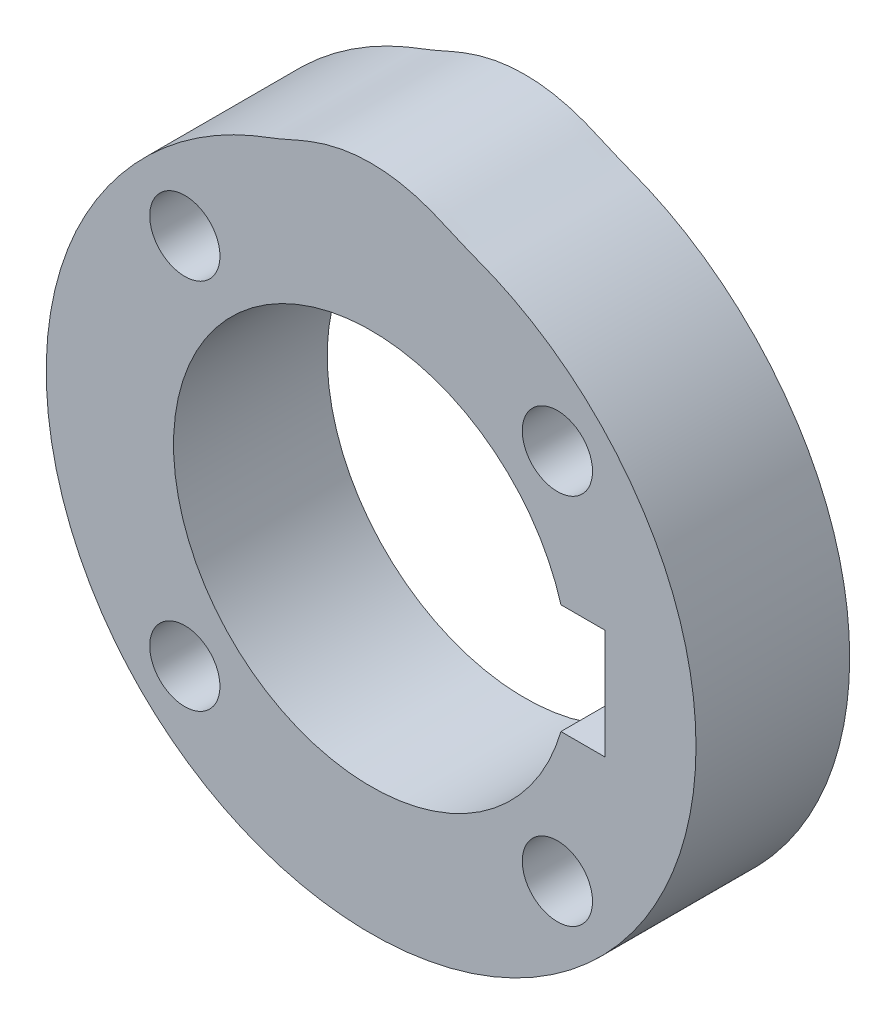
from build123d import *

# Parameters (mm, degrees)
SKIZZE1_R                       = 18
AUFSATZ_LINEAR_AUSTRAGEN1_DEPTH = 14
SCHNITT_LINEAR_AUSTRAGEN4_REACH = 47.228
SKIZZE1_3_R                     = 3.2
SCHNITT_LINEAR_AUSTRAGEN1_DEPTH = 46.22755624


with BuildPart() as part:
    # Skizze1 → Aufsatz-Linear austragen1 (new body)
    with BuildSketch(Plane.XY):
        with BuildLine():
            add(Edge.make_bspline(
                [(-22.821680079, 18.894446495), (-22.780676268, 18.945124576), (-22.630649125, 19.129381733), (-22.36818745, 19.44442358), (-22.03050613, 19.836378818), (-21.686416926, 20.222884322), (-21.33590609, 20.603837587), (-20.978975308, 20.978975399), (-20.615965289, 21.348495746), (-20.246670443, 21.711935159), (-19.871322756, 22.069386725), (-19.489997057, 22.420730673), (-19.102711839, 22.765813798), (-18.70959414, 23.104531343), (-18.310738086, 23.436776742), (-17.906249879, 23.762456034), (-17.496220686, 24.081548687), (-17.080576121, 24.393677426), (-16.659715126, 24.699155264), (-16.233459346, 24.997460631), (-15.802020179, 25.288633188), (-15.365647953, 25.572812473), (-14.924184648, 25.849502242), (-14.477869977, 26.118835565), (-14.026757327, 26.380616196), (-13.571065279, 26.634861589), (-13.110805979, 26.881251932), (-12.646169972, 27.119918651), (-12.177193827, 27.35053652), (-11.704139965, 27.573383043), (-11.226915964, 27.787759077), (-10.745925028, 27.99427584), (-10.261044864, 28.192246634), (-9.772484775, 28.381939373), (-9.282394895, 28.569620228), (-8.79232412, 28.760978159), (-8.302834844, 28.959609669), (-7.813863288, 29.167020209), (-7.324482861, 29.382068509), (-6.83263831, 29.599813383), (-6.339521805, 29.820879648), (-5.832214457, 30.013760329), (-5.331105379, 30.225124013), (-4.815164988, 30.400685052), (-4.29618891, 30.565612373), (-3.771248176, 30.711454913), (-3.241811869, 30.840171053), (-2.708081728, 30.949865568), (-2.170846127, 31.040570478), (-1.630692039, 31.111599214), (-1.088359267, 31.162212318), (-0.647234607, 31.188115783), (-0.387124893, 31.194442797), (-0.308461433, 31.195893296), (-0.239926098, 31.19715704), (-0.102842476, 31.198982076), (0.102842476, 31.198982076), (0.239926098, 31.19715704), (0.308461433, 31.195893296), (0.387124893, 31.194442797), (0.647234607, 31.188115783), (1.088359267, 31.162212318), (1.630692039, 31.111599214), (2.170846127, 31.040570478), (2.708081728, 30.949865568), (3.241811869, 30.840171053), (3.771248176, 30.711454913), (4.29618891, 30.565612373), (4.815164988, 30.400685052), (5.331105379, 30.225124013), (5.832214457, 30.013760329), (6.339521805, 29.820879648), (6.83263831, 29.599813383), (7.324482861, 29.382068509), (7.813863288, 29.167020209), (8.302834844, 28.959609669), (8.79232412, 28.760978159), (9.282394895, 28.569620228), (9.772484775, 28.381939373), (10.261044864, 28.192246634), (10.745925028, 27.99427584), (11.226915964, 27.787759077), (11.704139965, 27.573383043), (12.177193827, 27.35053652), (12.646169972, 27.119918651), (13.110805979, 26.881251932), (13.571065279, 26.634861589), (14.026757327, 26.380616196), (14.477869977, 26.118835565), (14.924184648, 25.849502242), (15.365647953, 25.572812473), (15.802020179, 25.288633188), (16.233459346, 24.997460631), (16.659715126, 24.699155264), (17.080576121, 24.393677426), (17.496220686, 24.081548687), (17.906249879, 23.762456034), (18.310738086, 23.436776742), (18.70959414, 23.104531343), (19.102711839, 22.765813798), (19.489997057, 22.420730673), (19.871322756, 22.069386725), (20.246670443, 21.711935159), (20.615965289, 21.348495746), (20.978975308, 20.978975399), (21.33590609, 20.603837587), (21.686416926, 20.222884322), (22.03050613, 19.836378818), (22.36818745, 19.44442358), (22.630649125, 19.129381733), (22.780676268, 18.945124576), (22.821680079, 18.894446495), (23.246798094, 18.369027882), (24.063383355, 17.2909637), (25.187166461, 15.590768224), (25.858974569, 14.41701027), (26.175760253, 13.819986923), (26.38777154, 13.420424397), (26.794667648, 12.612211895), (27.341972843, 11.366319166), (27.670080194, 10.523009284), (27.82438766, 10.097817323), (35.523881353, -11.118024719), (22.569761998, -29.600041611), (0, -29.600041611), (-22.569761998, -29.600041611), (-35.523881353, -11.118024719), (-27.82438766, 10.097817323), (-27.670080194, 10.523009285), (-27.341972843, 11.366319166), (-26.794667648, 12.612211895), (-26.38777154, 13.420424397), (-26.175760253, 13.819986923), (-25.858974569, 14.41701027), (-25.187166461, 15.590768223), (-24.063383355, 17.2909637), (-23.246798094, 18.369027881), (-22.821680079, 18.894446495)],
                knots=[0, 0, 0, 0, 0.001147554, 0.004182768, 0.007218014, 0.01025455, 0.013291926, 0.016330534, 0.019369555, 0.022410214, 0.02545127, 0.028493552, 0.031537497, 0.03458229, 0.037627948, 0.040675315, 0.043723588, 0.04677373, 0.049825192, 0.0528778, 0.055931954, 0.058987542, 0.062044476, 0.065103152, 0.068163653, 0.071225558, 0.074288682, 0.077353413, 0.080420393, 0.083488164, 0.08655821, 0.089629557, 0.092702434, 0.0957774, 0.098855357, 0.101940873, 0.105038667, 0.108154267, 0.111290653, 0.114448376, 0.117623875, 0.120800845, 0.124000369, 0.127194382, 0.130389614, 0.133586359, 0.136782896, 0.139979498, 0.143176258, 0.146372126, 0.149567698, 0.152763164, 0.154148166, 0.154148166, 0.154148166, 0.155354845, 0.156561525, 0.157768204, 0.157768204, 0.157768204, 0.159153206, 0.162348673, 0.165544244, 0.168740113, 0.171936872, 0.175133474, 0.178330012, 0.181526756, 0.184721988, 0.187916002, 0.191115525, 0.194292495, 0.197467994, 0.200625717, 0.203762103, 0.206877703, 0.209975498, 0.213061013, 0.21613897, 0.219213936, 0.222286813, 0.22535816, 0.228428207, 0.231495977, 0.234562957, 0.237627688, 0.240690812, 0.243752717, 0.246813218, 0.249871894, 0.252928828, 0.255984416, 0.25903857, 0.262091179, 0.26514264, 0.268192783, 0.271241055, 0.274288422, 0.27733408, 0.280378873, 0.283422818, 0.2864651, 0.289506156, 0.292546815, 0.295585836, 0.298624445, 0.30166182, 0.304698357, 0.307733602, 0.310768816, 0.31191637, 0.31191637, 0.31191637, 0.323813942, 0.335711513, 0.347609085, 0.347609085, 0.347609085, 0.355571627, 0.36353417, 0.371496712, 0.371496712, 0.371496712, 0.655958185, 0.655958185, 0.655958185, 0.940419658, 0.940419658, 0.940419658, 0.948382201, 0.956344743, 0.964307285, 0.964307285, 0.964307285, 0.976204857, 0.988102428, 1, 1, 1, 1], degree=3, weights=[1, 1, 1, 1, 1, 1, 1, 1, 1, 1, 1, 1, 1, 1, 1, 1, 1, 1, 1, 1, 1, 1, 1, 1, 1, 1, 1, 1, 1, 1, 1, 1, 1, 1, 1, 1, 1, 1, 1, 1, 1, 1, 1, 1, 1, 1, 1, 1, 1, 1, 1, 1, 1, 1, 1, 1, 1, 1, 1, 1, 1, 1, 1, 1, 1, 1, 1, 1, 1, 1, 1, 1, 1, 1, 1, 1, 1, 1, 1, 1, 1, 1, 1, 1, 1, 1, 1, 1, 1, 1, 1, 1, 1, 1, 1, 1, 1, 1, 1, 1, 1, 1, 1, 1, 1, 1, 1, 1, 1, 1, 1, 1, 1, 1, 1, 1, 1, 1, 1, 1, 1, 1, 0.715972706, 0.715972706, 1, 0.715972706, 0.715972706, 1, 1, 1, 1, 1, 1, 1, 1, 1, 1, 1]))
        make_face()
        Circle(SKIZZE1_R, mode=Mode.SUBTRACT)
    extrude(amount=AUFSATZ_LINEAR_AUSTRAGEN1_DEPTH)

    # Skizze15 → Schnitt-Linear austragen4 (cut, up to next)
    with BuildSketch(Plane.XY, mode=Mode.PRIVATE) as schnitt_linear_austragen4_sk1:
        with BuildLine():
            Line((21.3, 5), (17.291616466, 5))
            ThreePointArc((17.291616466, 5), (17.822024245, 2.524965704), (18, 0))
            ThreePointArc((18, 0), (17.822024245, -2.524965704), (17.291616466, -5))
            Line((17.291616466, -5), (21.3, -5))
            Line((21.3, -5), (21.3, 5))
        make_face()
    schnitt_linear_austragen4_tool1 = extrude(schnitt_linear_austragen4_sk1.sketch, amount=SCHNITT_LINEAR_AUSTRAGEN4_REACH, mode=Mode.PRIVATE) & part.part
    add(schnitt_linear_austragen4_tool1.solids().sort_by_distance((19.526608, 0, 0))[0], mode=Mode.SUBTRACT)

    # Skizze1_3 → Schnitt-Linear austragen1 (cut, through all)
    with BuildSketch(Plane.XY):
        with Locations((-16.970562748, 16.970562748)):
            Circle(SKIZZE1_3_R)
        with Locations((-16.970562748, -16.970562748)):
            Circle(SKIZZE1_3_R)
        with Locations((16.970562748, -16.970562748)):
            Circle(SKIZZE1_3_R)
        with Locations((16.970562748, 16.970562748)):
            Circle(SKIZZE1_3_R)
    extrude(amount=SCHNITT_LINEAR_AUSTRAGEN1_DEPTH, mode=Mode.SUBTRACT)


solid = part.part
